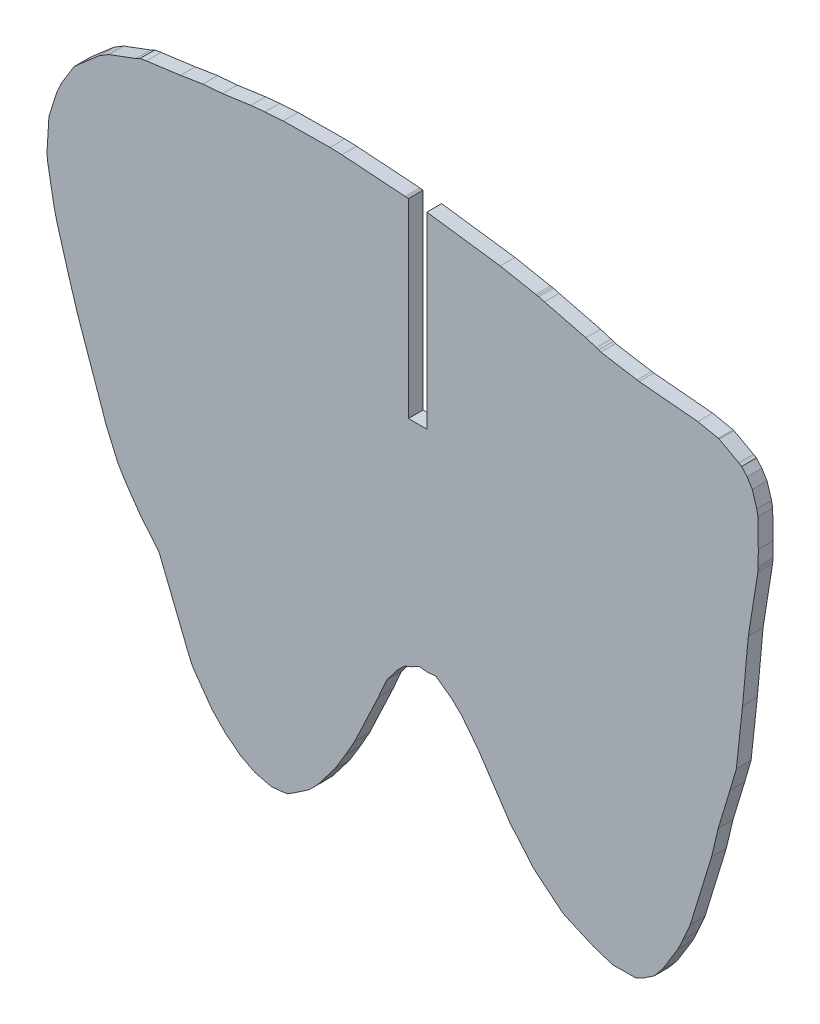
from build123d import *

# Parameters (mm, degrees)
EXTRUDE_1_DEPTH = 2


with BuildPart() as part:
    # Model → Extrude 1 (new body)
    with BuildSketch(Plane.XY):
        Polygon((-5863.5632, 44.1137), (-5863.8686, 44.2284), (-5864.1739, 44.3431), (-5865.6071, 44.7831), (-5871.2149, 46.1887), (-5871.9777, 46.4134), (-5872.1797, 46.4418), (-5872.3816, 46.4702), (-5877.1975, 47.4062), (-5887.1419, 48.7514), (-5887.1419, 23.2852), (-5887.3919, 23.2852), (-5889.3919, 23.2852), (-5889.6419, 23.2852), (-5889.6419, 49.081), (-5889.7779, 49.0973), (-5889.942, 49.1122), (-5890.1061, 49.127), (-5898.6709, 49.7298), (-5900.2594, 49.7837), (-5906.5927, 49.7165), (-5909.084, 49.5436), (-5910.991, 49.357), (-5914.8149, 48.8191), (-5917.4834, 48.6007), (-5920.5179, 48.1192), (-5925.1518, 47.4914), (-5925.9941, 47.3595), (-5926.5838, 47.0578), (-5930.2285, 45.7007), (-5931.5232, 44.9167), (-5934.2935, 42.5297), (-5934.9411, 41.9267), (-5936.6293, 39.1768), (-5937.2337, 37.8574), (-5938.2955, 34.5551), (-5938.3697, 33.9931), (-5938.6111, 29.9561), (-5938.5282, 29.0179), (-5937.6302, 24.0053), (-5937.2335, 22.4333), (-5935.6421, 16.9511), (-5934.473, 13.1571), (-5930.5729, 2.0142), (-5929.0115, -1.5977), (-5927.9432, -3.3532), (-5925.9771, -6.1894), (-5923.444, -9.2365), (-5919.52, -18.9817), (-5918.962, -20.28), (-5918.6303, -20.8015), (-5916.2527, -24.1468), (-5914.456, -26.0067), (-5912.3484, -27.6546), (-5910.4528, -28.6436), (-5909.1631, -28.9599), (-5908.2074, -29.1916), (-5906.894, -29.0714), (-5906.0158, -28.9392), (-5905.1091, -28.3714), (-5903.0823, -26.992), (-5901.8685, -25.7482), (-5899.5667, -22.7349), (-5898.1513, -20.4048), (-5896.8963, -18.1919), (-5893.7134, -11.4439), (-5892.5986, -8.8952), (-5891.1249, -6.959), (-5890.1272, -5.9983), (-5889.1884, -5.6214), (-5888.1608, -5.0754), (-5887.1645, -5.1916), (-5885.8962, -5.0954), (-5883.7462, -6.6745), (-5882.4505, -7.9116), (-5880.1731, -10.8319), (-5875.7422, -17.4769), (-5874.7675, -18.544), (-5872.6901, -21.0195), (-5868.9245, -24.1254), (-5868.8312, -24.1963), (-5868.738, -24.2672), (-5868.2444, -24.5264), (-5864.6068, -26.1127), (-5862.0447, -26.9508), (-5861.7205, -26.9741), (-5858.8231, -26.953), (-5857.8641, -26.4746), (-5856.3588, -25.4843), (-5855.2275, -24.1364), (-5853.087, -20.6459), (-5852.4504, -19.2992), (-5851.4537, -17.0187), (-5848.5583, -7.5932), (-5847.6707, -3.8197), (-5846.0706, 1.4416), (-5845.2095, 4.3943), (-5844.367, 12.2277), (-5843.5846, 20.7838), (-5842.2944, 28.9309), (-5842.271, 29.2725), (-5842.2477, 29.6142), (-5842.2384, 31.6282), (-5842.2868, 35.451), (-5842.3628, 35.8576), (-5842.4388, 36.2642), (-5843.047, 38.256), (-5843.7513, 39.4009), (-5844.5002, 40.2285), (-5844.8627, 40.4548), (-5847.517, 41.9156), (-5847.5854, 41.939), (-5847.6537, 41.9624), (-5850.423, 42.5281), (-5858.3848, 43.2599), (-5858.6548, 43.307), align=None)
    extrude(amount=EXTRUDE_1_DEPTH)


solid = part.part
